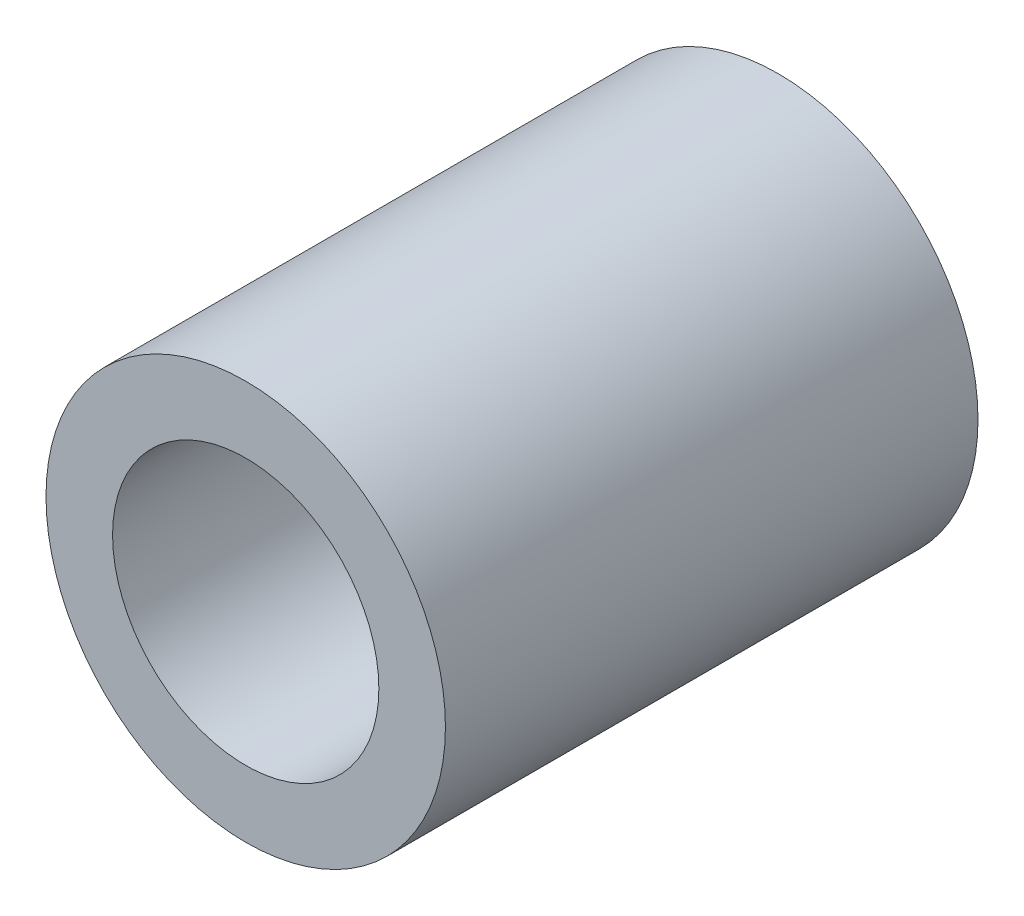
from build123d import *

# Parameters (mm, degrees)
ESQUISSE1_R          = 12
ESQUISSE1_R_2        = 8
BASE_EXTRUSION_DEPTH = 32


with BuildPart() as part:
    # Esquisse1 → Base-Extrusion (new body)
    with BuildSketch(Plane.XY):
        Circle(ESQUISSE1_R)
        Circle(ESQUISSE1_R_2, mode=Mode.SUBTRACT)
    extrude(amount=BASE_EXTRUSION_DEPTH)


solid = part.part
